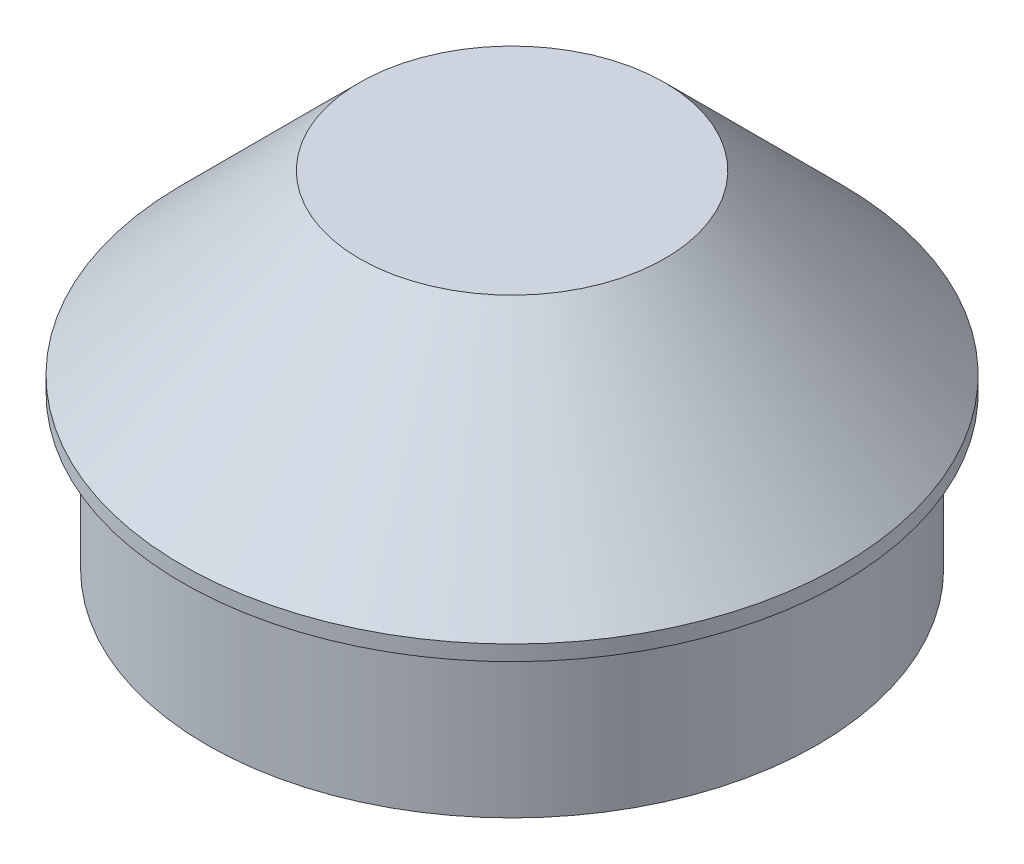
ISO-10303-21;
HEADER;
FILE_DESCRIPTION(('STEP AP214'),'2;1');
FILE_NAME('part.step','',(''),(''),'','','');
FILE_SCHEMA(('AUTOMOTIVE_DESIGN { 1 0 10303 214 1 1 1 1 }'));
ENDSEC;
DATA;
#1=APPLICATION_CONTEXT('core data for automotive mechanical design processes');
#2=APPLICATION_PROTOCOL_DEFINITION('international standard','automotive_design',2000,#1);
#3=PRODUCT_CONTEXT('',#1,'mechanical');
#4=PRODUCT('Part','Part','',(#3));
#5=PRODUCT_RELATED_PRODUCT_CATEGORY('part','',(#4));
#6=PRODUCT_DEFINITION_FORMATION('','',#4);
#7=PRODUCT_DEFINITION_CONTEXT('part definition',#1,'design');
#8=PRODUCT_DEFINITION('design','',#6,#7);
#9=PRODUCT_DEFINITION_SHAPE('','',#8);
#10=(LENGTH_UNIT() NAMED_UNIT(*) SI_UNIT(.MILLI.,.METRE.));
#11=(NAMED_UNIT(*) PLANE_ANGLE_UNIT() SI_UNIT($,.RADIAN.));
#12=(NAMED_UNIT(*) SI_UNIT($,.STERADIAN.) SOLID_ANGLE_UNIT());
#13=UNCERTAINTY_MEASURE_WITH_UNIT(LENGTH_MEASURE(1.E-05),#10,'distance_accuracy_value','');
#14=(GEOMETRIC_REPRESENTATION_CONTEXT(3) GLOBAL_UNCERTAINTY_ASSIGNED_CONTEXT((#13)) GLOBAL_UNIT_ASSIGNED_CONTEXT((#10,
#11,#12)) REPRESENTATION_CONTEXT('',''));
#15=CARTESIAN_POINT('',(0.,0.,0.));
#16=DIRECTION('',(0.,0.,1.));
#17=DIRECTION('',(1.,0.,0.));
#18=AXIS2_PLACEMENT_3D('',#15,#16,#17);
#19=CARTESIAN_POINT('',(0.,28.7020000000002,0.));
#20=DIRECTION('',(0.,-1.,0.));
#21=DIRECTION('',(0.,0.,-1.));
#22=AXIS2_PLACEMENT_3D('',#19,#20,#21);
#23=PLANE('',#22);
#24=CARTESIAN_POINT('',(0.,28.7020000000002,0.));
#25=DIRECTION('',(0.,-1.,0.));
#26=DIRECTION('',(0.,0.,-1.));
#27=AXIS2_PLACEMENT_3D('',#24,#25,#26);
#28=CIRCLE('',#27,12.7);
#29=CARTESIAN_POINT('',(0.,28.7020000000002,-12.7));
#30=VERTEX_POINT('',#29);
#31=EDGE_CURVE('E10',#30,#30,#28,.T.);
#32=ORIENTED_EDGE('',*,*,#31,.F.);
#33=EDGE_LOOP('',(#32));
#34=FACE_BOUND('',#33,.T.);
#35=ADVANCED_FACE('F31',(#34),#23,.F.);
#36=CARTESIAN_POINT('',(0.,28.7020000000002,0.));
#37=DIRECTION('',(0.,-1.,0.));
#38=DIRECTION('',(0.,0.,-1.));
#39=AXIS2_PLACEMENT_3D('',#36,#37,#38);
#40=CONICAL_SURFACE('',#39,12.7,0.785398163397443);
#41=CARTESIAN_POINT('',(0.,13.97,0.));
#42=DIRECTION('',(0.,-1.,0.));
#43=DIRECTION('',(0.,0.,-1.));
#44=AXIS2_PLACEMENT_3D('',#41,#42,#43);
#45=CIRCLE('',#44,27.432);
#46=CARTESIAN_POINT('',(0.,13.97,-27.432));
#47=VERTEX_POINT('',#46);
#48=EDGE_CURVE('E37',#47,#47,#45,.T.);
#49=ORIENTED_EDGE('',*,*,#48,.F.);
#50=EDGE_LOOP('',(#49));
#51=FACE_BOUND('',#50,.T.);
#52=ORIENTED_EDGE('',*,*,#31,.T.);
#53=EDGE_LOOP('',(#52));
#54=FACE_BOUND('',#53,.T.);
#55=ADVANCED_FACE('F70',(#51,#54),#40,.T.);
#56=CARTESIAN_POINT('',(0.,0.,0.));
#57=DIRECTION('',(0.,-1.,0.));
#58=DIRECTION('',(0.,0.,-1.));
#59=AXIS2_PLACEMENT_3D('',#56,#57,#58);
#60=CYLINDRICAL_SURFACE('',#59,27.432);
#61=CARTESIAN_POINT('',(0.,12.7,0.));
#62=DIRECTION('',(0.,-1.,0.));
#63=DIRECTION('',(0.,0.,-1.));
#64=AXIS2_PLACEMENT_3D('',#61,#62,#63);
#65=CIRCLE('',#64,27.432);
#66=CARTESIAN_POINT('',(0.,12.7,-27.432));
#67=VERTEX_POINT('',#66);
#68=EDGE_CURVE('E41',#67,#67,#65,.T.);
#69=ORIENTED_EDGE('',*,*,#68,.F.);
#70=EDGE_LOOP('',(#69));
#71=FACE_BOUND('',#70,.T.);
#72=ORIENTED_EDGE('',*,*,#48,.T.);
#73=EDGE_LOOP('',(#72));
#74=FACE_BOUND('',#73,.T.);
#75=ADVANCED_FACE('F65',(#71,#74),#60,.T.);
#76=CARTESIAN_POINT('',(-27.432,12.7,0.));
#77=DIRECTION('',(0.,1.,0.));
#78=DIRECTION('',(0.,0.,1.));
#79=AXIS2_PLACEMENT_3D('',#76,#77,#78);
#80=PLANE('',#79);
#81=CARTESIAN_POINT('',(0.,12.7,0.));
#82=DIRECTION('',(0.,-1.,0.));
#83=DIRECTION('',(0.,0.,-1.));
#84=AXIS2_PLACEMENT_3D('',#81,#82,#83);
#85=CIRCLE('',#84,25.4);
#86=CARTESIAN_POINT('',(0.,12.7,-25.4));
#87=VERTEX_POINT('',#86);
#88=EDGE_CURVE('E45',#87,#87,#85,.T.);
#89=ORIENTED_EDGE('',*,*,#88,.F.);
#90=EDGE_LOOP('',(#89));
#91=FACE_BOUND('',#90,.T.);
#92=ORIENTED_EDGE('',*,*,#68,.T.);
#93=EDGE_LOOP('',(#92));
#94=FACE_BOUND('',#93,.T.);
#95=ADVANCED_FACE('F59',(#91,#94),#80,.F.);
#96=CARTESIAN_POINT('',(0.,0.,0.));
#97=DIRECTION('',(0.,-1.,0.));
#98=DIRECTION('',(0.,0.,-1.));
#99=AXIS2_PLACEMENT_3D('',#96,#97,#98);
#100=CYLINDRICAL_SURFACE('',#99,25.4);
#101=CARTESIAN_POINT('',(0.,0.,0.));
#102=DIRECTION('',(0.,-1.,0.));
#103=DIRECTION('',(0.,0.,-1.));
#104=AXIS2_PLACEMENT_3D('',#101,#102,#103);
#105=CIRCLE('',#104,25.4);
#106=CARTESIAN_POINT('',(0.,0.,-25.4));
#107=VERTEX_POINT('',#106);
#108=EDGE_CURVE('E50',#107,#107,#105,.T.);
#109=ORIENTED_EDGE('',*,*,#108,.F.);
#110=EDGE_LOOP('',(#109));
#111=FACE_BOUND('',#110,.T.);
#112=ORIENTED_EDGE('',*,*,#88,.T.);
#113=EDGE_LOOP('',(#112));
#114=FACE_BOUND('',#113,.T.);
#115=ADVANCED_FACE('F56',(#111,#114),#100,.T.);
#116=CARTESIAN_POINT('',(-25.4,0.,0.));
#117=DIRECTION('',(0.,1.,0.));
#118=DIRECTION('',(0.,0.,1.));
#119=AXIS2_PLACEMENT_3D('',#116,#117,#118);
#120=PLANE('',#119);
#121=ORIENTED_EDGE('',*,*,#108,.T.);
#122=EDGE_LOOP('',(#121));
#123=FACE_BOUND('',#122,.T.);
#124=ADVANCED_FACE('F54',(#123),#120,.F.);
#125=CLOSED_SHELL('',(#35,#55,#75,#95,#115,#124));
#126=MANIFOLD_SOLID_BREP('B2',#125);
#127=ADVANCED_BREP_SHAPE_REPRESENTATION('',(#18,#126),#14);
#128=SHAPE_DEFINITION_REPRESENTATION(#9,#127);
ENDSEC;
END-ISO-10303-21;
